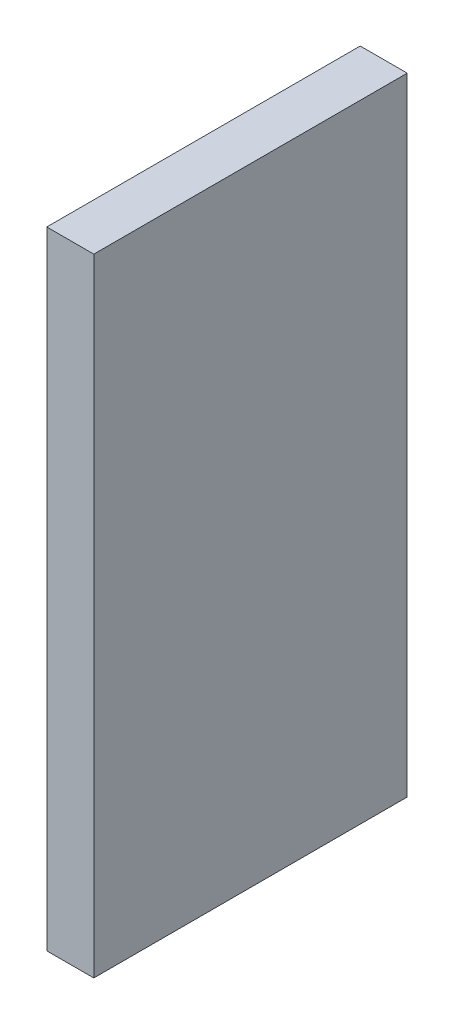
ISO-10303-21;
HEADER;
FILE_DESCRIPTION(('STEP AP214'),'2;1');
FILE_NAME('part.step','',(''),(''),'','','');
FILE_SCHEMA(('AUTOMOTIVE_DESIGN { 1 0 10303 214 1 1 1 1 }'));
ENDSEC;
DATA;
#1=APPLICATION_CONTEXT('core data for automotive mechanical design processes');
#2=APPLICATION_PROTOCOL_DEFINITION('international standard','automotive_design',2000,#1);
#3=PRODUCT_CONTEXT('',#1,'mechanical');
#4=PRODUCT('Part','Part','',(#3));
#5=PRODUCT_RELATED_PRODUCT_CATEGORY('part','',(#4));
#6=PRODUCT_DEFINITION_FORMATION('','',#4);
#7=PRODUCT_DEFINITION_CONTEXT('part definition',#1,'design');
#8=PRODUCT_DEFINITION('design','',#6,#7);
#9=PRODUCT_DEFINITION_SHAPE('','',#8);
#10=(LENGTH_UNIT() NAMED_UNIT(*) SI_UNIT(.MILLI.,.METRE.));
#11=(NAMED_UNIT(*) PLANE_ANGLE_UNIT() SI_UNIT($,.RADIAN.));
#12=(NAMED_UNIT(*) SI_UNIT($,.STERADIAN.) SOLID_ANGLE_UNIT());
#13=UNCERTAINTY_MEASURE_WITH_UNIT(LENGTH_MEASURE(1.E-05),#10,'distance_accuracy_value','');
#14=(GEOMETRIC_REPRESENTATION_CONTEXT(3) GLOBAL_UNCERTAINTY_ASSIGNED_CONTEXT((#13)) GLOBAL_UNIT_ASSIGNED_CONTEXT((#10,
#11,#12)) REPRESENTATION_CONTEXT('',''));
#15=CARTESIAN_POINT('',(0.,0.,0.));
#16=DIRECTION('',(0.,0.,1.));
#17=DIRECTION('',(1.,0.,0.));
#18=AXIS2_PLACEMENT_3D('',#15,#16,#17);
#19=CARTESIAN_POINT('',(14.5216968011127,-32.2660639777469,-30.0561711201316));
#20=DIRECTION('',(-1.,0.,0.));
#21=DIRECTION('',(0.,0.,1.));
#22=AXIS2_PLACEMENT_3D('',#19,#20,#21);
#23=PLANE('',#22);
#24=DIRECTION('',(0.,1.,0.));
#25=VECTOR('',#24,1.);
#26=CARTESIAN_POINT('',(14.5216968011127,-32.2660639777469,-10.));
#27=LINE('',#26,#25);
#28=CARTESIAN_POINT('',(14.5216968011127,-52.2660639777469,-10.));
#29=VERTEX_POINT('',#28);
#30=CARTESIAN_POINT('',(14.5216968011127,-32.2660639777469,-10.));
#31=VERTEX_POINT('',#30);
#32=EDGE_CURVE('E59',#29,#31,#27,.T.);
#33=ORIENTED_EDGE('',*,*,#32,.F.);
#34=DIRECTION('',(0.,0.,1.));
#35=VECTOR('',#34,1.);
#36=CARTESIAN_POINT('',(14.5216968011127,-52.2660639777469,-30.0561711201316));
#37=LINE('',#36,#35);
#38=CARTESIAN_POINT('',(14.5216968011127,-52.2660639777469,0.));
#39=VERTEX_POINT('',#38);
#40=EDGE_CURVE('E85',#29,#39,#37,.T.);
#41=ORIENTED_EDGE('',*,*,#40,.T.);
#42=DIRECTION('',(0.,-1.,0.));
#43=VECTOR('',#42,1.);
#44=CARTESIAN_POINT('',(14.5216968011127,-32.2660639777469,0.));
#45=LINE('',#44,#43);
#46=CARTESIAN_POINT('',(14.5216968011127,-32.2660639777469,0.));
#47=VERTEX_POINT('',#46);
#48=EDGE_CURVE('E89',#47,#39,#45,.T.);
#49=ORIENTED_EDGE('',*,*,#48,.F.);
#50=DIRECTION('',(0.,0.,1.));
#51=VECTOR('',#50,1.);
#52=CARTESIAN_POINT('',(14.5216968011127,-32.2660639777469,-30.0561711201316));
#53=LINE('',#52,#51);
#54=EDGE_CURVE('E130',#31,#47,#53,.T.);
#55=ORIENTED_EDGE('',*,*,#54,.F.);
#56=EDGE_LOOP('',(#33,#41,#49,#55));
#57=FACE_BOUND('',#56,.T.);
#58=ADVANCED_FACE('F49',(#57),#23,.T.);
#59=CARTESIAN_POINT('',(14.5216968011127,-32.2660639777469,-30.0561711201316));
#60=DIRECTION('',(0.,1.,0.));
#61=DIRECTION('',(0.,0.,1.));
#62=AXIS2_PLACEMENT_3D('',#59,#60,#61);
#63=PLANE('',#62);
#64=DIRECTION('',(1.,0.,0.));
#65=VECTOR('',#64,1.);
#66=CARTESIAN_POINT('',(14.5216968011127,-32.2660639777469,-10.));
#67=LINE('',#66,#65);
#68=CARTESIAN_POINT('',(16.0216968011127,-32.2660639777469,-10.));
#69=VERTEX_POINT('',#68);
#70=EDGE_CURVE('E174',#31,#69,#67,.T.);
#71=ORIENTED_EDGE('',*,*,#70,.F.);
#72=ORIENTED_EDGE('',*,*,#54,.T.);
#73=DIRECTION('',(-1.,0.,0.));
#74=VECTOR('',#73,1.);
#75=CARTESIAN_POINT('',(14.5216968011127,-32.2660639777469,0.));
#76=LINE('',#75,#74);
#77=CARTESIAN_POINT('',(16.0216968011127,-32.2660639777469,0.));
#78=VERTEX_POINT('',#77);
#79=EDGE_CURVE('E94',#78,#47,#76,.T.);
#80=ORIENTED_EDGE('',*,*,#79,.F.);
#81=DIRECTION('',(0.,0.,1.));
#82=VECTOR('',#81,1.);
#83=CARTESIAN_POINT('',(16.0216968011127,-32.2660639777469,-30.0561711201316));
#84=LINE('',#83,#82);
#85=EDGE_CURVE('E136',#69,#78,#84,.T.);
#86=ORIENTED_EDGE('',*,*,#85,.F.);
#87=EDGE_LOOP('',(#71,#72,#80,#86));
#88=FACE_BOUND('',#87,.T.);
#89=ADVANCED_FACE('F208',(#88),#63,.T.);
#90=CARTESIAN_POINT('',(16.0216968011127,-32.2660639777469,-30.0561711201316));
#91=DIRECTION('',(1.,0.,0.));
#92=DIRECTION('',(0.,1.,0.));
#93=AXIS2_PLACEMENT_3D('',#90,#91,#92);
#94=PLANE('',#93);
#95=DIRECTION('',(0.,-1.,0.));
#96=VECTOR('',#95,1.);
#97=CARTESIAN_POINT('',(16.0216968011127,-32.2660639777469,-10.));
#98=LINE('',#97,#96);
#99=CARTESIAN_POINT('',(16.0216968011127,-52.2660639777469,-10.));
#100=VERTEX_POINT('',#99);
#101=EDGE_CURVE('E135',#69,#100,#98,.T.);
#102=ORIENTED_EDGE('',*,*,#101,.F.);
#103=ORIENTED_EDGE('',*,*,#85,.T.);
#104=DIRECTION('',(0.,1.,0.));
#105=VECTOR('',#104,1.);
#106=CARTESIAN_POINT('',(16.0216968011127,-32.2660639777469,0.));
#107=LINE('',#106,#105);
#108=CARTESIAN_POINT('',(16.0216968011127,-52.2660639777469,0.));
#109=VERTEX_POINT('',#108);
#110=EDGE_CURVE('E103',#109,#78,#107,.T.);
#111=ORIENTED_EDGE('',*,*,#110,.F.);
#112=DIRECTION('',(0.,0.,1.));
#113=VECTOR('',#112,1.);
#114=CARTESIAN_POINT('',(16.0216968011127,-52.2660639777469,-30.0561711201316));
#115=LINE('',#114,#113);
#116=EDGE_CURVE('E93',#100,#109,#115,.T.);
#117=ORIENTED_EDGE('',*,*,#116,.F.);
#118=EDGE_LOOP('',(#102,#103,#111,#117));
#119=FACE_BOUND('',#118,.T.);
#120=ADVANCED_FACE('F210',(#119),#94,.T.);
#121=CARTESIAN_POINT('',(14.5216968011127,-52.2660639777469,-30.0561711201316));
#122=DIRECTION('',(0.,-1.,0.));
#123=DIRECTION('',(0.,0.,-1.));
#124=AXIS2_PLACEMENT_3D('',#121,#122,#123);
#125=PLANE('',#124);
#126=DIRECTION('',(-1.,0.,0.));
#127=VECTOR('',#126,1.);
#128=CARTESIAN_POINT('',(14.5216968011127,-52.2660639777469,-10.));
#129=LINE('',#128,#127);
#130=EDGE_CURVE('E12',#100,#29,#129,.T.);
#131=ORIENTED_EDGE('',*,*,#130,.F.);
#132=ORIENTED_EDGE('',*,*,#116,.T.);
#133=DIRECTION('',(1.,0.,0.));
#134=VECTOR('',#133,1.);
#135=CARTESIAN_POINT('',(14.5216968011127,-52.2660639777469,0.));
#136=LINE('',#135,#134);
#137=EDGE_CURVE('E96',#39,#109,#136,.T.);
#138=ORIENTED_EDGE('',*,*,#137,.F.);
#139=ORIENTED_EDGE('',*,*,#40,.F.);
#140=EDGE_LOOP('',(#131,#132,#138,#139));
#141=FACE_BOUND('',#140,.T.);
#142=ADVANCED_FACE('F97',(#141),#125,.T.);
#143=CARTESIAN_POINT('',(14.5216968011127,-52.2660639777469,0.));
#144=DIRECTION('',(0.,0.,1.));
#145=DIRECTION('',(1.,0.,0.));
#146=AXIS2_PLACEMENT_3D('',#143,#144,#145);
#147=PLANE('',#146);
#148=ORIENTED_EDGE('',*,*,#48,.T.);
#149=ORIENTED_EDGE('',*,*,#137,.T.);
#150=ORIENTED_EDGE('',*,*,#110,.T.);
#151=ORIENTED_EDGE('',*,*,#79,.T.);
#152=EDGE_LOOP('',(#148,#149,#150,#151));
#153=FACE_BOUND('',#152,.T.);
#154=ADVANCED_FACE('F104',(#153),#147,.T.);
#155=CARTESIAN_POINT('',(14.5216968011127,7.73393602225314,-10.));
#156=DIRECTION('',(0.,0.,1.));
#157=DIRECTION('',(1.,0.,0.));
#158=AXIS2_PLACEMENT_3D('',#155,#156,#157);
#159=PLANE('',#158);
#160=ORIENTED_EDGE('',*,*,#32,.T.);
#161=ORIENTED_EDGE('',*,*,#70,.T.);
#162=ORIENTED_EDGE('',*,*,#101,.T.);
#163=ORIENTED_EDGE('',*,*,#130,.T.);
#164=EDGE_LOOP('',(#160,#161,#162,#163));
#165=FACE_BOUND('',#164,.T.);
#166=ADVANCED_FACE('F204',(#165),#159,.F.);
#167=CLOSED_SHELL('',(#58,#89,#120,#142,#154,#166));
#168=MANIFOLD_SOLID_BREP('B2',#167);
#169=ADVANCED_BREP_SHAPE_REPRESENTATION('',(#18,#168),#14);
#170=SHAPE_DEFINITION_REPRESENTATION(#9,#169);
ENDSEC;
END-ISO-10303-21;
